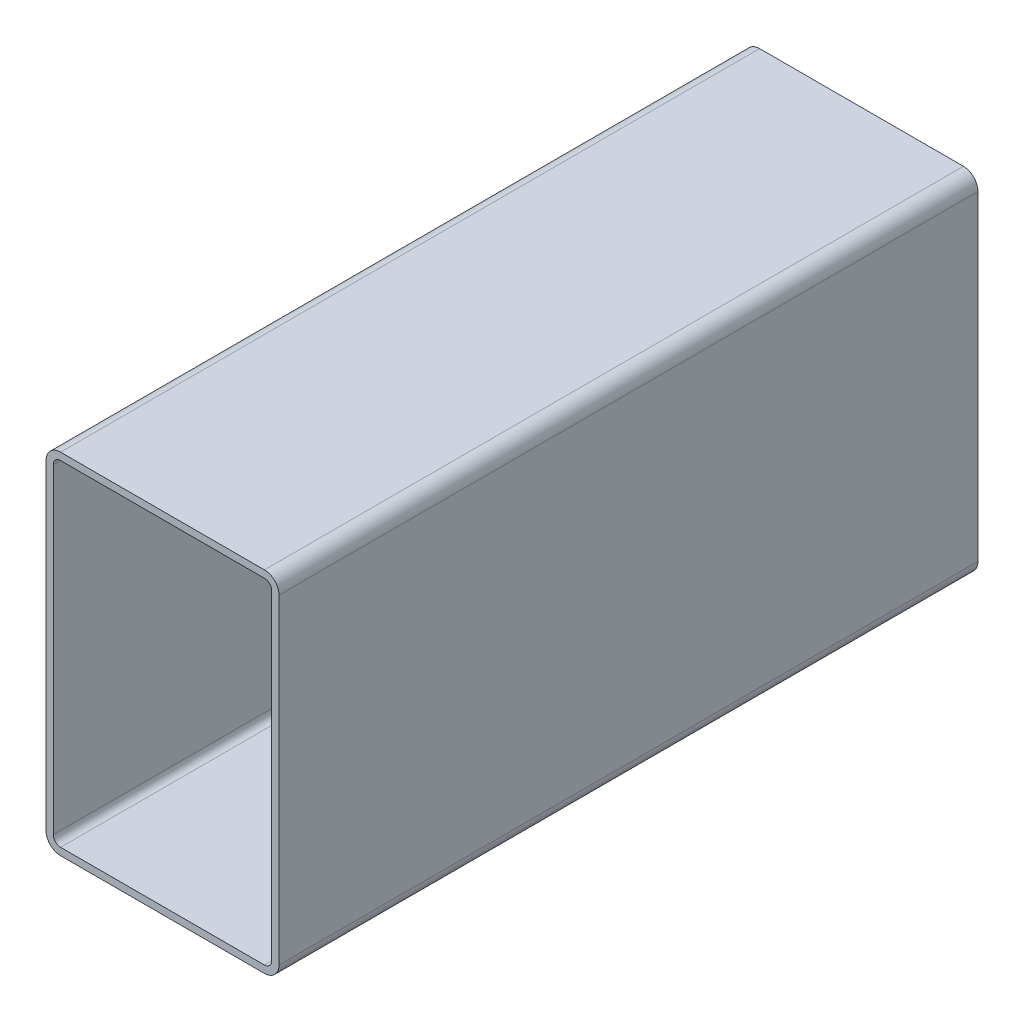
ISO-10303-21;
HEADER;
FILE_DESCRIPTION(('STEP AP214'),'2;1');
FILE_NAME('part.step','',(''),(''),'','','');
FILE_SCHEMA(('AUTOMOTIVE_DESIGN { 1 0 10303 214 1 1 1 1 }'));
ENDSEC;
DATA;
#1=APPLICATION_CONTEXT('core data for automotive mechanical design processes');
#2=APPLICATION_PROTOCOL_DEFINITION('international standard','automotive_design',2000,#1);
#3=PRODUCT_CONTEXT('',#1,'mechanical');
#4=PRODUCT('Part','Part','',(#3));
#5=PRODUCT_RELATED_PRODUCT_CATEGORY('part','',(#4));
#6=PRODUCT_DEFINITION_FORMATION('','',#4);
#7=PRODUCT_DEFINITION_CONTEXT('part definition',#1,'design');
#8=PRODUCT_DEFINITION('design','',#6,#7);
#9=PRODUCT_DEFINITION_SHAPE('','',#8);
#10=(LENGTH_UNIT() NAMED_UNIT(*) SI_UNIT(.MILLI.,.METRE.));
#11=(NAMED_UNIT(*) PLANE_ANGLE_UNIT() SI_UNIT($,.RADIAN.));
#12=(NAMED_UNIT(*) SI_UNIT($,.STERADIAN.) SOLID_ANGLE_UNIT());
#13=UNCERTAINTY_MEASURE_WITH_UNIT(LENGTH_MEASURE(1.E-05),#10,'distance_accuracy_value','');
#14=(GEOMETRIC_REPRESENTATION_CONTEXT(3) GLOBAL_UNCERTAINTY_ASSIGNED_CONTEXT((#13)) GLOBAL_UNIT_ASSIGNED_CONTEXT((#10,
#11,#12)) REPRESENTATION_CONTEXT('',''));
#15=CARTESIAN_POINT('',(0.,0.,0.));
#16=DIRECTION('',(0.,0.,1.));
#17=DIRECTION('',(1.,0.,0.));
#18=AXIS2_PLACEMENT_3D('',#15,#16,#17);
#19=CARTESIAN_POINT('',(8.02517782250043,148.061948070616,304.8));
#20=DIRECTION('',(0.,0.,1.));
#21=DIRECTION('',(1.,0.,0.));
#22=AXIS2_PLACEMENT_3D('',#19,#20,#21);
#23=PLANE('',#22);
#24=CARTESIAN_POINT('',(8.02517782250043,148.061948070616,304.8));
#25=DIRECTION('',(0.,0.,1.));
#26=DIRECTION('',(1.,0.,0.));
#27=AXIS2_PLACEMENT_3D('',#24,#25,#26);
#28=CIRCLE('',#27,6.35);
#29=CARTESIAN_POINT('',(8.02517782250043,154.411948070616,304.8));
#30=VERTEX_POINT('',#29);
#31=CARTESIAN_POINT('',(1.67517782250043,148.061948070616,304.8));
#32=VERTEX_POINT('',#31);
#33=EDGE_CURVE('E211',#30,#32,#28,.T.);
#34=ORIENTED_EDGE('',*,*,#33,.T.);
#35=DIRECTION('',(0.,-1.,0.));
#36=VECTOR('',#35,1.);
#37=CARTESIAN_POINT('',(1.67517782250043,8.36194807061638,304.8));
#38=LINE('',#37,#36);
#39=CARTESIAN_POINT('',(1.67517782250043,8.36194807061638,304.8));
#40=VERTEX_POINT('',#39);
#41=EDGE_CURVE('E214',#32,#40,#38,.T.);
#42=ORIENTED_EDGE('',*,*,#41,.T.);
#43=CARTESIAN_POINT('',(8.02517782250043,8.36194807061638,304.8));
#44=DIRECTION('',(0.,0.,1.));
#45=DIRECTION('',(1.,0.,0.));
#46=AXIS2_PLACEMENT_3D('',#43,#44,#45);
#47=CIRCLE('',#46,6.35);
#48=CARTESIAN_POINT('',(8.02517782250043,2.01194807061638,304.8));
#49=VERTEX_POINT('',#48);
#50=EDGE_CURVE('E217',#40,#49,#47,.T.);
#51=ORIENTED_EDGE('',*,*,#50,.T.);
#52=DIRECTION('',(1.,0.,0.));
#53=VECTOR('',#52,1.);
#54=CARTESIAN_POINT('',(96.9251778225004,2.01194807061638,304.8));
#55=LINE('',#54,#53);
#56=CARTESIAN_POINT('',(96.9251778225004,2.01194807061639,304.8));
#57=VERTEX_POINT('',#56);
#58=EDGE_CURVE('E219',#49,#57,#55,.T.);
#59=ORIENTED_EDGE('',*,*,#58,.T.);
#60=CARTESIAN_POINT('',(96.9251778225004,8.36194807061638,304.8));
#61=DIRECTION('',(0.,0.,1.));
#62=DIRECTION('',(1.,0.,0.));
#63=AXIS2_PLACEMENT_3D('',#60,#61,#62);
#64=CIRCLE('',#63,6.35);
#65=CARTESIAN_POINT('',(103.2751778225,8.36194807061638,304.8));
#66=VERTEX_POINT('',#65);
#67=EDGE_CURVE('E221',#57,#66,#64,.T.);
#68=ORIENTED_EDGE('',*,*,#67,.T.);
#69=DIRECTION('',(0.,1.,0.));
#70=VECTOR('',#69,1.);
#71=CARTESIAN_POINT('',(103.2751778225,148.061948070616,304.8));
#72=LINE('',#71,#70);
#73=CARTESIAN_POINT('',(103.2751778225,148.061948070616,304.8));
#74=VERTEX_POINT('',#73);
#75=EDGE_CURVE('E223',#66,#74,#72,.T.);
#76=ORIENTED_EDGE('',*,*,#75,.T.);
#77=CARTESIAN_POINT('',(96.9251778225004,148.061948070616,304.8));
#78=DIRECTION('',(0.,0.,1.));
#79=DIRECTION('',(1.,0.,0.));
#80=AXIS2_PLACEMENT_3D('',#77,#78,#79);
#81=CIRCLE('',#80,6.34999999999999);
#82=CARTESIAN_POINT('',(96.9251778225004,154.411948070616,304.8));
#83=VERTEX_POINT('',#82);
#84=EDGE_CURVE('E225',#74,#83,#81,.T.);
#85=ORIENTED_EDGE('',*,*,#84,.T.);
#86=DIRECTION('',(-1.,0.,0.));
#87=VECTOR('',#86,1.);
#88=CARTESIAN_POINT('',(8.02517782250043,154.411948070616,304.8));
#89=LINE('',#88,#87);
#90=EDGE_CURVE('E227',#83,#30,#89,.T.);
#91=ORIENTED_EDGE('',*,*,#90,.T.);
#92=EDGE_LOOP('',(#34,#42,#51,#59,#68,#76,#85,#91));
#93=FACE_BOUND('',#92,.T.);
#94=DIRECTION('',(0.,-1.,0.));
#95=VECTOR('',#94,1.);
#96=CARTESIAN_POINT('',(4.85017782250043,8.36194807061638,304.8));
#97=LINE('',#96,#95);
#98=CARTESIAN_POINT('',(4.85017782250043,148.061948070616,304.8));
#99=VERTEX_POINT('',#98);
#100=CARTESIAN_POINT('',(4.85017782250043,8.36194807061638,304.8));
#101=VERTEX_POINT('',#100);
#102=EDGE_CURVE('E154',#99,#101,#97,.T.);
#103=ORIENTED_EDGE('',*,*,#102,.F.);
#104=CARTESIAN_POINT('',(8.02517782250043,148.061948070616,304.8));
#105=DIRECTION('',(0.,0.,1.));
#106=DIRECTION('',(1.,0.,0.));
#107=AXIS2_PLACEMENT_3D('',#104,#105,#106);
#108=CIRCLE('',#107,3.17500000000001);
#109=CARTESIAN_POINT('',(8.02517782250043,151.236948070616,304.8));
#110=VERTEX_POINT('',#109);
#111=EDGE_CURVE('E146',#110,#99,#108,.T.);
#112=ORIENTED_EDGE('',*,*,#111,.F.);
#113=DIRECTION('',(-1.,0.,0.));
#114=VECTOR('',#113,1.);
#115=CARTESIAN_POINT('',(8.02517782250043,151.236948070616,304.8));
#116=LINE('',#115,#114);
#117=CARTESIAN_POINT('',(96.9251778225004,151.236948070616,304.8));
#118=VERTEX_POINT('',#117);
#119=EDGE_CURVE('E179',#118,#110,#116,.T.);
#120=ORIENTED_EDGE('',*,*,#119,.F.);
#121=CARTESIAN_POINT('',(96.9251778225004,148.061948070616,304.8));
#122=DIRECTION('',(0.,0.,1.));
#123=DIRECTION('',(1.,0.,0.));
#124=AXIS2_PLACEMENT_3D('',#121,#122,#123);
#125=CIRCLE('',#124,3.175);
#126=CARTESIAN_POINT('',(100.1001778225,148.061948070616,304.8));
#127=VERTEX_POINT('',#126);
#128=EDGE_CURVE('E177',#127,#118,#125,.T.);
#129=ORIENTED_EDGE('',*,*,#128,.F.);
#130=DIRECTION('',(0.,1.,0.));
#131=VECTOR('',#130,1.);
#132=CARTESIAN_POINT('',(100.1001778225,148.061948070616,304.8));
#133=LINE('',#132,#131);
#134=CARTESIAN_POINT('',(100.1001778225,8.36194807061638,304.8));
#135=VERTEX_POINT('',#134);
#136=EDGE_CURVE('E175',#135,#127,#133,.T.);
#137=ORIENTED_EDGE('',*,*,#136,.F.);
#138=CARTESIAN_POINT('',(96.9251778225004,8.36194807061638,304.8));
#139=DIRECTION('',(0.,0.,1.));
#140=DIRECTION('',(1.,0.,0.));
#141=AXIS2_PLACEMENT_3D('',#138,#139,#140);
#142=CIRCLE('',#141,3.175);
#143=CARTESIAN_POINT('',(96.9251778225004,5.18694807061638,304.8));
#144=VERTEX_POINT('',#143);
#145=EDGE_CURVE('E173',#144,#135,#142,.T.);
#146=ORIENTED_EDGE('',*,*,#145,.F.);
#147=DIRECTION('',(1.,0.,0.));
#148=VECTOR('',#147,1.);
#149=CARTESIAN_POINT('',(96.9251778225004,5.18694807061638,304.8));
#150=LINE('',#149,#148);
#151=CARTESIAN_POINT('',(8.02517782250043,5.18694807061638,304.8));
#152=VERTEX_POINT('',#151);
#153=EDGE_CURVE('E169',#152,#144,#150,.T.);
#154=ORIENTED_EDGE('',*,*,#153,.F.);
#155=CARTESIAN_POINT('',(8.02517782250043,8.36194807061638,304.8));
#156=DIRECTION('',(0.,0.,1.));
#157=DIRECTION('',(1.,0.,0.));
#158=AXIS2_PLACEMENT_3D('',#155,#156,#157);
#159=CIRCLE('',#158,3.175);
#160=EDGE_CURVE('E167',#101,#152,#159,.T.);
#161=ORIENTED_EDGE('',*,*,#160,.F.);
#162=EDGE_LOOP('',(#103,#112,#120,#129,#137,#146,#154,#161));
#163=FACE_BOUND('',#162,.T.);
#164=ADVANCED_FACE('F33',(#93,#163),#23,.T.);
#165=CARTESIAN_POINT('',(8.02517782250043,148.061948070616,0.));
#166=DIRECTION('',(0.,0.,1.));
#167=DIRECTION('',(1.,0.,0.));
#168=AXIS2_PLACEMENT_3D('',#165,#166,#167);
#169=PLANE('',#168);
#170=CARTESIAN_POINT('',(8.02517782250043,148.061948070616,0.));
#171=DIRECTION('',(0.,0.,1.));
#172=DIRECTION('',(1.,0.,0.));
#173=AXIS2_PLACEMENT_3D('',#170,#171,#172);
#174=CIRCLE('',#173,6.35);
#175=CARTESIAN_POINT('',(8.02517782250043,154.411948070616,0.));
#176=VERTEX_POINT('',#175);
#177=CARTESIAN_POINT('',(1.67517782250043,148.061948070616,0.));
#178=VERTEX_POINT('',#177);
#179=EDGE_CURVE('E162',#176,#178,#174,.T.);
#180=ORIENTED_EDGE('',*,*,#179,.F.);
#181=DIRECTION('',(-1.,0.,0.));
#182=VECTOR('',#181,1.);
#183=CARTESIAN_POINT('',(8.02517782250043,154.411948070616,0.));
#184=LINE('',#183,#182);
#185=CARTESIAN_POINT('',(96.9251778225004,154.411948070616,0.));
#186=VERTEX_POINT('',#185);
#187=EDGE_CURVE('E215',#186,#176,#184,.T.);
#188=ORIENTED_EDGE('',*,*,#187,.F.);
#189=CARTESIAN_POINT('',(96.9251778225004,148.061948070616,0.));
#190=DIRECTION('',(0.,0.,1.));
#191=DIRECTION('',(1.,0.,0.));
#192=AXIS2_PLACEMENT_3D('',#189,#190,#191);
#193=CIRCLE('',#192,6.34999999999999);
#194=CARTESIAN_POINT('',(103.2751778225,148.061948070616,0.));
#195=VERTEX_POINT('',#194);
#196=EDGE_CURVE('E242',#195,#186,#193,.T.);
#197=ORIENTED_EDGE('',*,*,#196,.F.);
#198=DIRECTION('',(0.,1.,0.));
#199=VECTOR('',#198,1.);
#200=CARTESIAN_POINT('',(103.2751778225,148.061948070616,0.));
#201=LINE('',#200,#199);
#202=CARTESIAN_POINT('',(103.2751778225,8.36194807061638,0.));
#203=VERTEX_POINT('',#202);
#204=EDGE_CURVE('E240',#203,#195,#201,.T.);
#205=ORIENTED_EDGE('',*,*,#204,.F.);
#206=CARTESIAN_POINT('',(96.9251778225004,8.36194807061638,0.));
#207=DIRECTION('',(0.,0.,1.));
#208=DIRECTION('',(1.,0.,0.));
#209=AXIS2_PLACEMENT_3D('',#206,#207,#208);
#210=CIRCLE('',#209,6.35);
#211=CARTESIAN_POINT('',(96.9251778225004,2.01194807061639,0.));
#212=VERTEX_POINT('',#211);
#213=EDGE_CURVE('E238',#212,#203,#210,.T.);
#214=ORIENTED_EDGE('',*,*,#213,.F.);
#215=DIRECTION('',(1.,0.,0.));
#216=VECTOR('',#215,1.);
#217=CARTESIAN_POINT('',(96.9251778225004,2.01194807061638,0.));
#218=LINE('',#217,#216);
#219=CARTESIAN_POINT('',(8.02517782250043,2.01194807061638,0.));
#220=VERTEX_POINT('',#219);
#221=EDGE_CURVE('E236',#220,#212,#218,.T.);
#222=ORIENTED_EDGE('',*,*,#221,.F.);
#223=CARTESIAN_POINT('',(8.02517782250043,8.36194807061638,0.));
#224=DIRECTION('',(0.,0.,1.));
#225=DIRECTION('',(1.,0.,0.));
#226=AXIS2_PLACEMENT_3D('',#223,#224,#225);
#227=CIRCLE('',#226,6.35);
#228=CARTESIAN_POINT('',(1.67517782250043,8.36194807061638,0.));
#229=VERTEX_POINT('',#228);
#230=EDGE_CURVE('E234',#229,#220,#227,.T.);
#231=ORIENTED_EDGE('',*,*,#230,.F.);
#232=DIRECTION('',(0.,-1.,0.));
#233=VECTOR('',#232,1.);
#234=CARTESIAN_POINT('',(1.67517782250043,8.36194807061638,0.));
#235=LINE('',#234,#233);
#236=EDGE_CURVE('E232',#178,#229,#235,.T.);
#237=ORIENTED_EDGE('',*,*,#236,.F.);
#238=EDGE_LOOP('',(#180,#188,#197,#205,#214,#222,#231,#237));
#239=FACE_BOUND('',#238,.T.);
#240=CARTESIAN_POINT('',(8.02517782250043,148.061948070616,0.));
#241=DIRECTION('',(0.,0.,1.));
#242=DIRECTION('',(1.,0.,0.));
#243=AXIS2_PLACEMENT_3D('',#240,#241,#242);
#244=CIRCLE('',#243,3.17500000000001);
#245=CARTESIAN_POINT('',(8.02517782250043,151.236948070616,0.));
#246=VERTEX_POINT('',#245);
#247=CARTESIAN_POINT('',(4.85017782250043,148.061948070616,0.));
#248=VERTEX_POINT('',#247);
#249=EDGE_CURVE('E56',#246,#248,#244,.T.);
#250=ORIENTED_EDGE('',*,*,#249,.T.);
#251=DIRECTION('',(0.,-1.,0.));
#252=VECTOR('',#251,1.);
#253=CARTESIAN_POINT('',(4.85017782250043,8.36194807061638,0.));
#254=LINE('',#253,#252);
#255=CARTESIAN_POINT('',(4.85017782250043,8.36194807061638,0.));
#256=VERTEX_POINT('',#255);
#257=EDGE_CURVE('E161',#248,#256,#254,.T.);
#258=ORIENTED_EDGE('',*,*,#257,.T.);
#259=CARTESIAN_POINT('',(8.02517782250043,8.36194807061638,0.));
#260=DIRECTION('',(0.,0.,1.));
#261=DIRECTION('',(1.,0.,0.));
#262=AXIS2_PLACEMENT_3D('',#259,#260,#261);
#263=CIRCLE('',#262,3.175);
#264=CARTESIAN_POINT('',(8.02517782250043,5.18694807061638,0.));
#265=VERTEX_POINT('',#264);
#266=EDGE_CURVE('E183',#256,#265,#263,.T.);
#267=ORIENTED_EDGE('',*,*,#266,.T.);
#268=DIRECTION('',(1.,0.,0.));
#269=VECTOR('',#268,1.);
#270=CARTESIAN_POINT('',(96.9251778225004,5.18694807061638,0.));
#271=LINE('',#270,#269);
#272=CARTESIAN_POINT('',(96.9251778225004,5.18694807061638,0.));
#273=VERTEX_POINT('',#272);
#274=EDGE_CURVE('E186',#265,#273,#271,.T.);
#275=ORIENTED_EDGE('',*,*,#274,.T.);
#276=CARTESIAN_POINT('',(96.9251778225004,8.36194807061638,0.));
#277=DIRECTION('',(0.,0.,1.));
#278=DIRECTION('',(1.,0.,0.));
#279=AXIS2_PLACEMENT_3D('',#276,#277,#278);
#280=CIRCLE('',#279,3.175);
#281=CARTESIAN_POINT('',(100.1001778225,8.36194807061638,0.));
#282=VERTEX_POINT('',#281);
#283=EDGE_CURVE('E189',#273,#282,#280,.T.);
#284=ORIENTED_EDGE('',*,*,#283,.T.);
#285=DIRECTION('',(0.,1.,0.));
#286=VECTOR('',#285,1.);
#287=CARTESIAN_POINT('',(100.1001778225,148.061948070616,0.));
#288=LINE('',#287,#286);
#289=CARTESIAN_POINT('',(100.1001778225,148.061948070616,0.));
#290=VERTEX_POINT('',#289);
#291=EDGE_CURVE('E192',#282,#290,#288,.T.);
#292=ORIENTED_EDGE('',*,*,#291,.T.);
#293=CARTESIAN_POINT('',(96.9251778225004,148.061948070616,0.));
#294=DIRECTION('',(0.,0.,1.));
#295=DIRECTION('',(1.,0.,0.));
#296=AXIS2_PLACEMENT_3D('',#293,#294,#295);
#297=CIRCLE('',#296,3.175);
#298=CARTESIAN_POINT('',(96.9251778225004,151.236948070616,0.));
#299=VERTEX_POINT('',#298);
#300=EDGE_CURVE('E195',#290,#299,#297,.T.);
#301=ORIENTED_EDGE('',*,*,#300,.T.);
#302=DIRECTION('',(-1.,0.,0.));
#303=VECTOR('',#302,1.);
#304=CARTESIAN_POINT('',(8.02517782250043,151.236948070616,0.));
#305=LINE('',#304,#303);
#306=EDGE_CURVE('E155',#299,#246,#305,.T.);
#307=ORIENTED_EDGE('',*,*,#306,.T.);
#308=EDGE_LOOP('',(#250,#258,#267,#275,#284,#292,#301,#307));
#309=FACE_BOUND('',#308,.T.);
#310=ADVANCED_FACE('F272',(#239,#309),#169,.F.);
#311=CARTESIAN_POINT('',(8.02517782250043,148.061948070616,304.8));
#312=DIRECTION('',(0.,0.,-1.));
#313=DIRECTION('',(-1.,0.,0.));
#314=AXIS2_PLACEMENT_3D('',#311,#312,#313);
#315=CYLINDRICAL_SURFACE('',#314,6.35);
#316=ORIENTED_EDGE('',*,*,#179,.T.);
#317=DIRECTION('',(0.,0.,-1.));
#318=VECTOR('',#317,1.);
#319=CARTESIAN_POINT('',(1.67517782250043,148.061948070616,304.8));
#320=LINE('',#319,#318);
#321=EDGE_CURVE('E11',#32,#178,#320,.T.);
#322=ORIENTED_EDGE('',*,*,#321,.F.);
#323=ORIENTED_EDGE('',*,*,#33,.F.);
#324=DIRECTION('',(0.,0.,-1.));
#325=VECTOR('',#324,1.);
#326=CARTESIAN_POINT('',(8.02517782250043,154.411948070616,304.8));
#327=LINE('',#326,#325);
#328=EDGE_CURVE('E229',#30,#176,#327,.T.);
#329=ORIENTED_EDGE('',*,*,#328,.T.);
#330=EDGE_LOOP('',(#316,#322,#323,#329));
#331=FACE_BOUND('',#330,.T.);
#332=ADVANCED_FACE('F35',(#331),#315,.T.);
#333=CARTESIAN_POINT('',(1.67517782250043,8.36194807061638,304.8));
#334=DIRECTION('',(1.,0.,0.));
#335=DIRECTION('',(0.,0.,-1.));
#336=AXIS2_PLACEMENT_3D('',#333,#334,#335);
#337=PLANE('',#336);
#338=ORIENTED_EDGE('',*,*,#236,.T.);
#339=DIRECTION('',(0.,0.,-1.));
#340=VECTOR('',#339,1.);
#341=CARTESIAN_POINT('',(1.67517782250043,8.36194807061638,304.8));
#342=LINE('',#341,#340);
#343=EDGE_CURVE('E41',#40,#229,#342,.T.);
#344=ORIENTED_EDGE('',*,*,#343,.F.);
#345=ORIENTED_EDGE('',*,*,#41,.F.);
#346=ORIENTED_EDGE('',*,*,#321,.T.);
#347=EDGE_LOOP('',(#338,#344,#345,#346));
#348=FACE_BOUND('',#347,.T.);
#349=ADVANCED_FACE('F289',(#348),#337,.F.);
#350=CARTESIAN_POINT('',(8.02517782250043,8.36194807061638,304.8));
#351=DIRECTION('',(0.,0.,-1.));
#352=DIRECTION('',(-1.,0.,0.));
#353=AXIS2_PLACEMENT_3D('',#350,#351,#352);
#354=CYLINDRICAL_SURFACE('',#353,6.35);
#355=ORIENTED_EDGE('',*,*,#230,.T.);
#356=DIRECTION('',(0.,0.,-1.));
#357=VECTOR('',#356,1.);
#358=CARTESIAN_POINT('',(8.02517782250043,2.01194807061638,304.8));
#359=LINE('',#358,#357);
#360=EDGE_CURVE('E259',#49,#220,#359,.T.);
#361=ORIENTED_EDGE('',*,*,#360,.F.);
#362=ORIENTED_EDGE('',*,*,#50,.F.);
#363=ORIENTED_EDGE('',*,*,#343,.T.);
#364=EDGE_LOOP('',(#355,#361,#362,#363));
#365=FACE_BOUND('',#364,.T.);
#366=ADVANCED_FACE('F266',(#365),#354,.T.);
#367=CARTESIAN_POINT('',(96.9251778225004,2.01194807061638,304.8));
#368=DIRECTION('',(0.,1.,0.));
#369=DIRECTION('',(0.,0.,1.));
#370=AXIS2_PLACEMENT_3D('',#367,#368,#369);
#371=PLANE('',#370);
#372=ORIENTED_EDGE('',*,*,#221,.T.);
#373=DIRECTION('',(0.,0.,-1.));
#374=VECTOR('',#373,1.);
#375=CARTESIAN_POINT('',(96.9251778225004,2.01194807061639,304.8));
#376=LINE('',#375,#374);
#377=EDGE_CURVE('E256',#57,#212,#376,.T.);
#378=ORIENTED_EDGE('',*,*,#377,.F.);
#379=ORIENTED_EDGE('',*,*,#58,.F.);
#380=ORIENTED_EDGE('',*,*,#360,.T.);
#381=EDGE_LOOP('',(#372,#378,#379,#380));
#382=FACE_BOUND('',#381,.T.);
#383=ADVANCED_FACE('F278',(#382),#371,.F.);
#384=CARTESIAN_POINT('',(96.9251778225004,8.36194807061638,304.8));
#385=DIRECTION('',(0.,0.,-1.));
#386=DIRECTION('',(-1.,0.,0.));
#387=AXIS2_PLACEMENT_3D('',#384,#385,#386);
#388=CYLINDRICAL_SURFACE('',#387,6.35);
#389=ORIENTED_EDGE('',*,*,#213,.T.);
#390=DIRECTION('',(0.,0.,-1.));
#391=VECTOR('',#390,1.);
#392=CARTESIAN_POINT('',(103.2751778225,8.36194807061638,304.8));
#393=LINE('',#392,#391);
#394=EDGE_CURVE('E253',#66,#203,#393,.T.);
#395=ORIENTED_EDGE('',*,*,#394,.F.);
#396=ORIENTED_EDGE('',*,*,#67,.F.);
#397=ORIENTED_EDGE('',*,*,#377,.T.);
#398=EDGE_LOOP('',(#389,#395,#396,#397));
#399=FACE_BOUND('',#398,.T.);
#400=ADVANCED_FACE('F282',(#399),#388,.T.);
#401=CARTESIAN_POINT('',(103.2751778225,148.061948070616,304.8));
#402=DIRECTION('',(-1.,0.,0.));
#403=DIRECTION('',(0.,0.,1.));
#404=AXIS2_PLACEMENT_3D('',#401,#402,#403);
#405=PLANE('',#404);
#406=ORIENTED_EDGE('',*,*,#204,.T.);
#407=DIRECTION('',(0.,0.,-1.));
#408=VECTOR('',#407,1.);
#409=CARTESIAN_POINT('',(103.2751778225,148.061948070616,304.8));
#410=LINE('',#409,#408);
#411=EDGE_CURVE('E250',#74,#195,#410,.T.);
#412=ORIENTED_EDGE('',*,*,#411,.F.);
#413=ORIENTED_EDGE('',*,*,#75,.F.);
#414=ORIENTED_EDGE('',*,*,#394,.T.);
#415=EDGE_LOOP('',(#406,#412,#413,#414));
#416=FACE_BOUND('',#415,.T.);
#417=ADVANCED_FACE('F302',(#416),#405,.F.);
#418=CARTESIAN_POINT('',(96.9251778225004,148.061948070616,304.8));
#419=DIRECTION('',(0.,0.,-1.));
#420=DIRECTION('',(-1.,0.,0.));
#421=AXIS2_PLACEMENT_3D('',#418,#419,#420);
#422=CYLINDRICAL_SURFACE('',#421,6.34999999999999);
#423=ORIENTED_EDGE('',*,*,#196,.T.);
#424=DIRECTION('',(0.,0.,-1.));
#425=VECTOR('',#424,1.);
#426=CARTESIAN_POINT('',(96.9251778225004,154.411948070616,304.8));
#427=LINE('',#426,#425);
#428=EDGE_CURVE('E247',#83,#186,#427,.T.);
#429=ORIENTED_EDGE('',*,*,#428,.F.);
#430=ORIENTED_EDGE('',*,*,#84,.F.);
#431=ORIENTED_EDGE('',*,*,#411,.T.);
#432=EDGE_LOOP('',(#423,#429,#430,#431));
#433=FACE_BOUND('',#432,.T.);
#434=ADVANCED_FACE('F300',(#433),#422,.T.);
#435=CARTESIAN_POINT('',(8.02517782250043,154.411948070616,304.8));
#436=DIRECTION('',(0.,-1.,0.));
#437=DIRECTION('',(0.,0.,-1.));
#438=AXIS2_PLACEMENT_3D('',#435,#436,#437);
#439=PLANE('',#438);
#440=ORIENTED_EDGE('',*,*,#187,.T.);
#441=ORIENTED_EDGE('',*,*,#328,.F.);
#442=ORIENTED_EDGE('',*,*,#90,.F.);
#443=ORIENTED_EDGE('',*,*,#428,.T.);
#444=EDGE_LOOP('',(#440,#441,#442,#443));
#445=FACE_BOUND('',#444,.T.);
#446=ADVANCED_FACE('F295',(#445),#439,.F.);
#447=CARTESIAN_POINT('',(8.02517782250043,148.061948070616,304.8));
#448=DIRECTION('',(0.,0.,-1.));
#449=DIRECTION('',(-1.,0.,0.));
#450=AXIS2_PLACEMENT_3D('',#447,#448,#449);
#451=CYLINDRICAL_SURFACE('',#450,3.17500000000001);
#452=ORIENTED_EDGE('',*,*,#249,.F.);
#453=DIRECTION('',(0.,0.,-1.));
#454=VECTOR('',#453,1.);
#455=CARTESIAN_POINT('',(8.02517782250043,151.236948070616,304.8));
#456=LINE('',#455,#454);
#457=EDGE_CURVE('E150',#110,#246,#456,.T.);
#458=ORIENTED_EDGE('',*,*,#457,.F.);
#459=ORIENTED_EDGE('',*,*,#111,.T.);
#460=DIRECTION('',(0.,0.,-1.));
#461=VECTOR('',#460,1.);
#462=CARTESIAN_POINT('',(4.85017782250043,148.061948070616,304.8));
#463=LINE('',#462,#461);
#464=EDGE_CURVE('E149',#99,#248,#463,.T.);
#465=ORIENTED_EDGE('',*,*,#464,.T.);
#466=EDGE_LOOP('',(#452,#458,#459,#465));
#467=FACE_BOUND('',#466,.T.);
#468=ADVANCED_FACE('F148',(#467),#451,.F.);
#469=CARTESIAN_POINT('',(4.85017782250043,8.36194807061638,304.8));
#470=DIRECTION('',(1.,0.,0.));
#471=DIRECTION('',(0.,0.,-1.));
#472=AXIS2_PLACEMENT_3D('',#469,#470,#471);
#473=PLANE('',#472);
#474=ORIENTED_EDGE('',*,*,#257,.F.);
#475=ORIENTED_EDGE('',*,*,#464,.F.);
#476=ORIENTED_EDGE('',*,*,#102,.T.);
#477=DIRECTION('',(0.,0.,-1.));
#478=VECTOR('',#477,1.);
#479=CARTESIAN_POINT('',(4.85017782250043,8.36194807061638,304.8));
#480=LINE('',#479,#478);
#481=EDGE_CURVE('E163',#101,#256,#480,.T.);
#482=ORIENTED_EDGE('',*,*,#481,.T.);
#483=EDGE_LOOP('',(#474,#475,#476,#482));
#484=FACE_BOUND('',#483,.T.);
#485=ADVANCED_FACE('F158',(#484),#473,.T.);
#486=CARTESIAN_POINT('',(8.02517782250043,8.36194807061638,304.8));
#487=DIRECTION('',(0.,0.,-1.));
#488=DIRECTION('',(-1.,0.,0.));
#489=AXIS2_PLACEMENT_3D('',#486,#487,#488);
#490=CYLINDRICAL_SURFACE('',#489,3.175);
#491=ORIENTED_EDGE('',*,*,#266,.F.);
#492=ORIENTED_EDGE('',*,*,#481,.F.);
#493=ORIENTED_EDGE('',*,*,#160,.T.);
#494=DIRECTION('',(0.,0.,-1.));
#495=VECTOR('',#494,1.);
#496=CARTESIAN_POINT('',(8.02517782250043,5.18694807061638,304.8));
#497=LINE('',#496,#495);
#498=EDGE_CURVE('E208',#152,#265,#497,.T.);
#499=ORIENTED_EDGE('',*,*,#498,.T.);
#500=EDGE_LOOP('',(#491,#492,#493,#499));
#501=FACE_BOUND('',#500,.T.);
#502=ADVANCED_FACE('F327',(#501),#490,.F.);
#503=CARTESIAN_POINT('',(96.9251778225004,5.18694807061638,304.8));
#504=DIRECTION('',(0.,1.,0.));
#505=DIRECTION('',(0.,0.,1.));
#506=AXIS2_PLACEMENT_3D('',#503,#504,#505);
#507=PLANE('',#506);
#508=ORIENTED_EDGE('',*,*,#274,.F.);
#509=ORIENTED_EDGE('',*,*,#498,.F.);
#510=ORIENTED_EDGE('',*,*,#153,.T.);
#511=DIRECTION('',(0.,0.,-1.));
#512=VECTOR('',#511,1.);
#513=CARTESIAN_POINT('',(96.9251778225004,5.18694807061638,304.8));
#514=LINE('',#513,#512);
#515=EDGE_CURVE('E206',#144,#273,#514,.T.);
#516=ORIENTED_EDGE('',*,*,#515,.T.);
#517=EDGE_LOOP('',(#508,#509,#510,#516));
#518=FACE_BOUND('',#517,.T.);
#519=ADVANCED_FACE('F331',(#518),#507,.T.);
#520=CARTESIAN_POINT('',(96.9251778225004,8.36194807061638,304.8));
#521=DIRECTION('',(0.,0.,-1.));
#522=DIRECTION('',(-1.,0.,0.));
#523=AXIS2_PLACEMENT_3D('',#520,#521,#522);
#524=CYLINDRICAL_SURFACE('',#523,3.175);
#525=ORIENTED_EDGE('',*,*,#283,.F.);
#526=ORIENTED_EDGE('',*,*,#515,.F.);
#527=ORIENTED_EDGE('',*,*,#145,.T.);
#528=DIRECTION('',(0.,0.,-1.));
#529=VECTOR('',#528,1.);
#530=CARTESIAN_POINT('',(100.1001778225,8.36194807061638,304.8));
#531=LINE('',#530,#529);
#532=EDGE_CURVE('E204',#135,#282,#531,.T.);
#533=ORIENTED_EDGE('',*,*,#532,.T.);
#534=EDGE_LOOP('',(#525,#526,#527,#533));
#535=FACE_BOUND('',#534,.T.);
#536=ADVANCED_FACE('F337',(#535),#524,.F.);
#537=CARTESIAN_POINT('',(100.1001778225,148.061948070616,304.8));
#538=DIRECTION('',(-1.,0.,0.));
#539=DIRECTION('',(0.,0.,1.));
#540=AXIS2_PLACEMENT_3D('',#537,#538,#539);
#541=PLANE('',#540);
#542=ORIENTED_EDGE('',*,*,#291,.F.);
#543=ORIENTED_EDGE('',*,*,#532,.F.);
#544=ORIENTED_EDGE('',*,*,#136,.T.);
#545=DIRECTION('',(0.,0.,-1.));
#546=VECTOR('',#545,1.);
#547=CARTESIAN_POINT('',(100.1001778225,148.061948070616,304.8));
#548=LINE('',#547,#546);
#549=EDGE_CURVE('E202',#127,#290,#548,.T.);
#550=ORIENTED_EDGE('',*,*,#549,.T.);
#551=EDGE_LOOP('',(#542,#543,#544,#550));
#552=FACE_BOUND('',#551,.T.);
#553=ADVANCED_FACE('F341',(#552),#541,.T.);
#554=CARTESIAN_POINT('',(96.9251778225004,148.061948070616,304.8));
#555=DIRECTION('',(0.,0.,-1.));
#556=DIRECTION('',(-1.,0.,0.));
#557=AXIS2_PLACEMENT_3D('',#554,#555,#556);
#558=CYLINDRICAL_SURFACE('',#557,3.175);
#559=ORIENTED_EDGE('',*,*,#300,.F.);
#560=ORIENTED_EDGE('',*,*,#549,.F.);
#561=ORIENTED_EDGE('',*,*,#128,.T.);
#562=DIRECTION('',(0.,0.,-1.));
#563=VECTOR('',#562,1.);
#564=CARTESIAN_POINT('',(96.9251778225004,151.236948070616,304.8));
#565=LINE('',#564,#563);
#566=EDGE_CURVE('E48',#118,#299,#565,.T.);
#567=ORIENTED_EDGE('',*,*,#566,.T.);
#568=EDGE_LOOP('',(#559,#560,#561,#567));
#569=FACE_BOUND('',#568,.T.);
#570=ADVANCED_FACE('F345',(#569),#558,.F.);
#571=CARTESIAN_POINT('',(8.02517782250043,151.236948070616,304.8));
#572=DIRECTION('',(0.,-1.,0.));
#573=DIRECTION('',(0.,0.,-1.));
#574=AXIS2_PLACEMENT_3D('',#571,#572,#573);
#575=PLANE('',#574);
#576=ORIENTED_EDGE('',*,*,#306,.F.);
#577=ORIENTED_EDGE('',*,*,#566,.F.);
#578=ORIENTED_EDGE('',*,*,#119,.T.);
#579=ORIENTED_EDGE('',*,*,#457,.T.);
#580=EDGE_LOOP('',(#576,#577,#578,#579));
#581=FACE_BOUND('',#580,.T.);
#582=ADVANCED_FACE('F349',(#581),#575,.T.);
#583=CLOSED_SHELL('',(#164,#310,#332,#349,#366,#383,#400,#417,#434,#446,#468,#485,#502,#519,
#536,#553,#570,#582));
#584=MANIFOLD_SOLID_BREP('B2',#583);
#585=ADVANCED_BREP_SHAPE_REPRESENTATION('',(#18,#584),#14);
#586=SHAPE_DEFINITION_REPRESENTATION(#9,#585);
ENDSEC;
END-ISO-10303-21;
